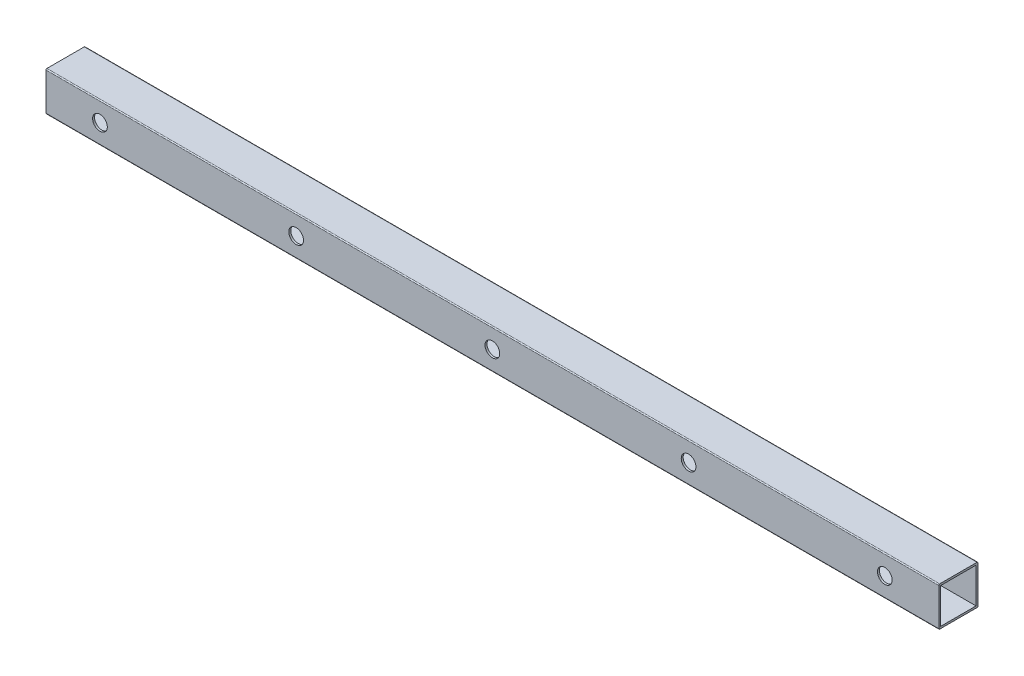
from build123d import *

# Parameters (mm, degrees)
SKETCH_1_W             = 18
SKETCH_1_H             = 18
EXTRUDE_1_DEPTH        = 227.5
SKETCH_2_R             = 3.75
CUT_EXTRUDE_2_DEPTH    = 229.596259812
PATTERN_LINEAR_1_COUNT = 7
PATTERN_LINEAR_1_PITCH = 100
SKETCH_3_R             = 2.25
CUT_EXTRUDE_3_DEPTH    = 1
PATTERN_LINEAR_2_COUNT = 6
PATTERN_LINEAR_2_PITCH = 100


with BuildPart() as part:
    # Sketch 1 → Extrude 1 (new, symmetric)
    with BuildSketch(Plane(origin=(0, 0, 0), x_dir=(0, 0, -1), z_dir=(1, 0, 0))):
        with BuildLine():
            Line((-9.5, -10), (9.5, -10))
            ThreePointArc((9.5, -10), (9.853553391, -9.853553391), (10, -9.5))
            Line((10, -9.5), (10, 9.5))
            ThreePointArc((10, 9.5), (9.853553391, 9.853553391), (9.5, 10))
            Line((9.5, 10), (-9.5, 10))
            ThreePointArc((-9.5, 10), (-9.853553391, 9.853553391), (-10, 9.5))
            Line((-10, 9.5), (-10, -9.5))
            ThreePointArc((-10, -9.5), (-9.853553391, -9.853553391), (-9.5, -10))
        make_face()
        Rectangle(SKETCH_1_W, SKETCH_1_H, mode=Mode.SUBTRACT)
    extrude(amount=EXTRUDE_1_DEPTH, both=True)

    # Sketch 2 → Cut-Extrude 2 (cut, through all)
    with BuildSketch(Plane(origin=(0, 0, -10), x_dir=(-1, 0, 0), z_dir=(0, 0, -1))):
        with Locations((-200, 0)):
            Circle(SKETCH_2_R)
    cut_extrude_2 = extrude(amount=-CUT_EXTRUDE_2_DEPTH, mode=Mode.SUBTRACT)

    # Pattern Linear 1: Cut-Extrude 2 ×7
    with Locations(*[(-i * PATTERN_LINEAR_1_PITCH, 0, 0) for i in range(1, PATTERN_LINEAR_1_COUNT)]):
        add(cut_extrude_2, mode=Mode.SUBTRACT)

    # Sketch 3 → Cut-Extrude 3 (cut)
    with BuildSketch(Plane(origin=(0, 0, -10), x_dir=(-1, 0, 0), z_dir=(0, 0, -1))):
        with Locations((-175, 0)):
            Circle(SKETCH_3_R)
        with Locations((-150, 0)):
            Circle(SKETCH_3_R)
        with Locations((-125, 0)):
            Circle(SKETCH_3_R)
    cut_extrude_3 = extrude(amount=-CUT_EXTRUDE_3_DEPTH, mode=Mode.SUBTRACT)

    # Pattern Linear 2: Cut-Extrude 3 ×6
    with Locations(*[(-i * PATTERN_LINEAR_2_PITCH, 0, 0) for i in range(1, PATTERN_LINEAR_2_COUNT)]):
        add(cut_extrude_3, mode=Mode.SUBTRACT)


solid = part.part
